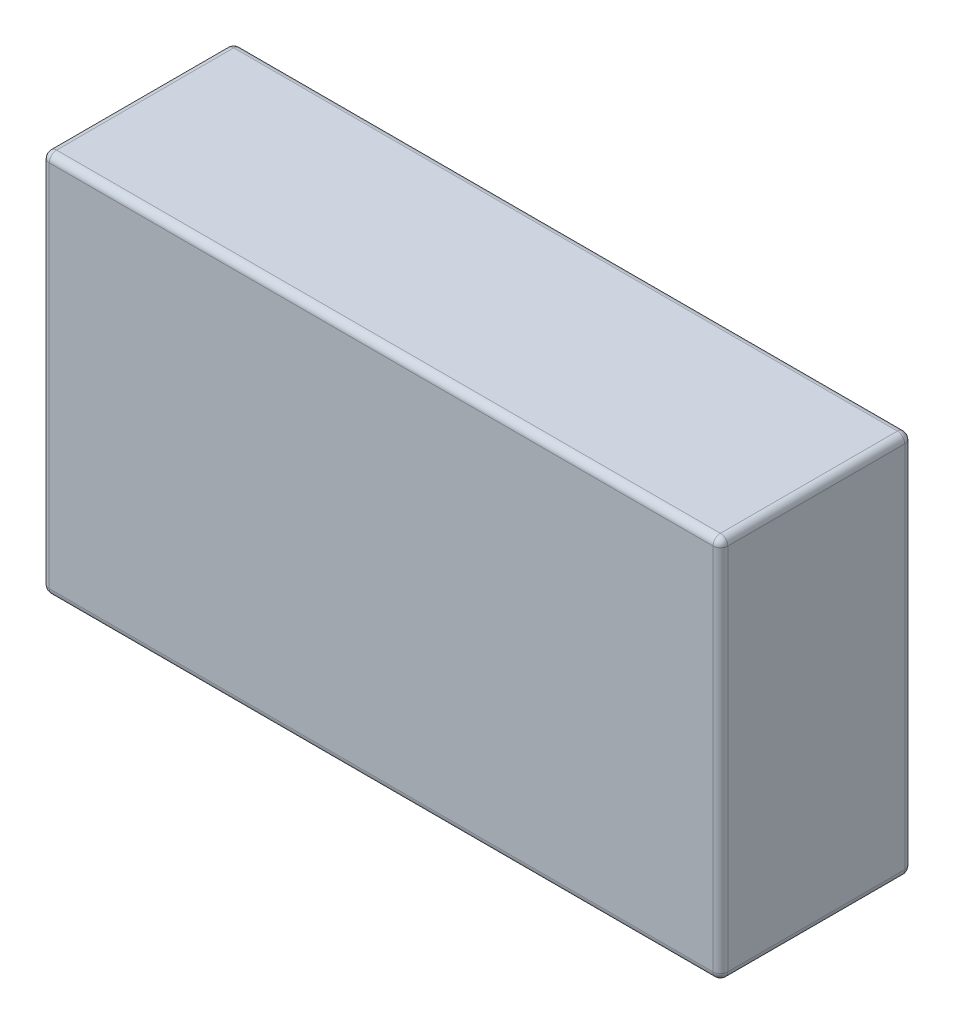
ISO-10303-21;
HEADER;
FILE_DESCRIPTION(('STEP AP214'),'2;1');
FILE_NAME('part.step','',(''),(''),'','','');
FILE_SCHEMA(('AUTOMOTIVE_DESIGN { 1 0 10303 214 1 1 1 1 }'));
ENDSEC;
DATA;
#1=APPLICATION_CONTEXT('core data for automotive mechanical design processes');
#2=APPLICATION_PROTOCOL_DEFINITION('international standard','automotive_design',2000,#1);
#3=PRODUCT_CONTEXT('',#1,'mechanical');
#4=PRODUCT('Part','Part','',(#3));
#5=PRODUCT_RELATED_PRODUCT_CATEGORY('part','',(#4));
#6=PRODUCT_DEFINITION_FORMATION('','',#4);
#7=PRODUCT_DEFINITION_CONTEXT('part definition',#1,'design');
#8=PRODUCT_DEFINITION('design','',#6,#7);
#9=PRODUCT_DEFINITION_SHAPE('','',#8);
#10=(LENGTH_UNIT() NAMED_UNIT(*) SI_UNIT(.MILLI.,.METRE.));
#11=(NAMED_UNIT(*) PLANE_ANGLE_UNIT() SI_UNIT($,.RADIAN.));
#12=(NAMED_UNIT(*) SI_UNIT($,.STERADIAN.) SOLID_ANGLE_UNIT());
#13=UNCERTAINTY_MEASURE_WITH_UNIT(LENGTH_MEASURE(1.E-05),#10,'distance_accuracy_value','');
#14=(GEOMETRIC_REPRESENTATION_CONTEXT(3) GLOBAL_UNCERTAINTY_ASSIGNED_CONTEXT((#13)) GLOBAL_UNIT_ASSIGNED_CONTEXT((#10,
#11,#12)) REPRESENTATION_CONTEXT('',''));
#15=CARTESIAN_POINT('',(0.,0.,0.));
#16=DIRECTION('',(0.,0.,1.));
#17=DIRECTION('',(1.,0.,0.));
#18=AXIS2_PLACEMENT_3D('',#15,#16,#17);
#19=CARTESIAN_POINT('',(0.,0.,13.));
#20=DIRECTION('',(1.,0.,0.));
#21=DIRECTION('',(0.,1.,0.));
#22=AXIS2_PLACEMENT_3D('',#19,#20,#21);
#23=PLANE('',#22);
#24=DIRECTION('',(0.,-1.,0.));
#25=VECTOR('',#24,1.);
#26=CARTESIAN_POINT('',(0.,0.,0.5));
#27=LINE('',#26,#25);
#28=CARTESIAN_POINT('',(0.,25.5,0.5));
#29=VERTEX_POINT('',#28);
#30=CARTESIAN_POINT('',(0.,0.5,0.5));
#31=VERTEX_POINT('',#30);
#32=EDGE_CURVE('E180',#29,#31,#27,.T.);
#33=ORIENTED_EDGE('',*,*,#32,.T.);
#34=DIRECTION('',(0.,0.,-1.));
#35=VECTOR('',#34,1.);
#36=CARTESIAN_POINT('',(0.,0.5,13.));
#37=LINE('',#36,#35);
#38=CARTESIAN_POINT('',(0.,0.5,12.5));
#39=VERTEX_POINT('',#38);
#40=EDGE_CURVE('E182',#31,#39,#37,.F.);
#41=ORIENTED_EDGE('',*,*,#40,.T.);
#42=DIRECTION('',(0.,-1.,0.));
#43=VECTOR('',#42,1.);
#44=CARTESIAN_POINT('',(0.,0.,12.5));
#45=LINE('',#44,#43);
#46=CARTESIAN_POINT('',(0.,25.5,12.5));
#47=VERTEX_POINT('',#46);
#48=EDGE_CURVE('E176',#39,#47,#45,.F.);
#49=ORIENTED_EDGE('',*,*,#48,.T.);
#50=DIRECTION('',(0.,0.,-1.));
#51=VECTOR('',#50,1.);
#52=CARTESIAN_POINT('',(0.,25.5,13.));
#53=LINE('',#52,#51);
#54=EDGE_CURVE('E178',#47,#29,#53,.T.);
#55=ORIENTED_EDGE('',*,*,#54,.T.);
#56=EDGE_LOOP('',(#33,#41,#49,#55));
#57=FACE_BOUND('',#56,.T.);
#58=ADVANCED_FACE('F45',(#57),#23,.F.);
#59=CARTESIAN_POINT('',(0.,0.,13.));
#60=DIRECTION('',(0.,1.,0.));
#61=DIRECTION('',(0.,0.,1.));
#62=AXIS2_PLACEMENT_3D('',#59,#60,#61);
#63=PLANE('',#62);
#64=DIRECTION('',(1.,0.,0.));
#65=VECTOR('',#64,1.);
#66=CARTESIAN_POINT('',(0.,0.,12.5));
#67=LINE('',#66,#65);
#68=CARTESIAN_POINT('',(45.5,0.,12.5));
#69=VERTEX_POINT('',#68);
#70=CARTESIAN_POINT('',(0.5,0.,12.5));
#71=VERTEX_POINT('',#70);
#72=EDGE_CURVE('E137',#69,#71,#67,.F.);
#73=ORIENTED_EDGE('',*,*,#72,.T.);
#74=DIRECTION('',(0.,0.,-1.));
#75=VECTOR('',#74,1.);
#76=CARTESIAN_POINT('',(0.5,0.,13.));
#77=LINE('',#76,#75);
#78=CARTESIAN_POINT('',(0.5,0.,0.5));
#79=VERTEX_POINT('',#78);
#80=EDGE_CURVE('E174',#71,#79,#77,.T.);
#81=ORIENTED_EDGE('',*,*,#80,.T.);
#82=DIRECTION('',(1.,0.,0.));
#83=VECTOR('',#82,1.);
#84=CARTESIAN_POINT('',(46.,0.,0.5));
#85=LINE('',#84,#83);
#86=CARTESIAN_POINT('',(45.5,0.,0.5));
#87=VERTEX_POINT('',#86);
#88=EDGE_CURVE('E140',#79,#87,#85,.T.);
#89=ORIENTED_EDGE('',*,*,#88,.T.);
#90=DIRECTION('',(0.,0.,-1.));
#91=VECTOR('',#90,1.);
#92=CARTESIAN_POINT('',(45.5,0.,13.));
#93=LINE('',#92,#91);
#94=EDGE_CURVE('E132',#87,#69,#93,.F.);
#95=ORIENTED_EDGE('',*,*,#94,.T.);
#96=EDGE_LOOP('',(#73,#81,#89,#95));
#97=FACE_BOUND('',#96,.T.);
#98=ADVANCED_FACE('F134',(#97),#63,.F.);
#99=CARTESIAN_POINT('',(46.,0.,13.));
#100=DIRECTION('',(-1.,0.,0.));
#101=DIRECTION('',(0.,-1.,0.));
#102=AXIS2_PLACEMENT_3D('',#99,#100,#101);
#103=PLANE('',#102);
#104=DIRECTION('',(0.,0.,-1.));
#105=VECTOR('',#104,1.);
#106=CARTESIAN_POINT('',(46.,0.5,13.));
#107=LINE('',#106,#105);
#108=CARTESIAN_POINT('',(46.,0.5,12.5));
#109=VERTEX_POINT('',#108);
#110=CARTESIAN_POINT('',(46.,0.5,0.5));
#111=VERTEX_POINT('',#110);
#112=EDGE_CURVE('E151',#109,#111,#107,.T.);
#113=ORIENTED_EDGE('',*,*,#112,.T.);
#114=DIRECTION('',(0.,1.,0.));
#115=VECTOR('',#114,1.);
#116=CARTESIAN_POINT('',(46.,26.,0.5));
#117=LINE('',#116,#115);
#118=CARTESIAN_POINT('',(46.,25.5,0.5));
#119=VERTEX_POINT('',#118);
#120=EDGE_CURVE('E208',#111,#119,#117,.T.);
#121=ORIENTED_EDGE('',*,*,#120,.T.);
#122=DIRECTION('',(0.,0.,-1.));
#123=VECTOR('',#122,1.);
#124=CARTESIAN_POINT('',(46.,25.5,13.));
#125=LINE('',#124,#123);
#126=CARTESIAN_POINT('',(46.,25.5,12.5));
#127=VERTEX_POINT('',#126);
#128=EDGE_CURVE('E205',#119,#127,#125,.F.);
#129=ORIENTED_EDGE('',*,*,#128,.T.);
#130=DIRECTION('',(0.,1.,0.));
#131=VECTOR('',#130,1.);
#132=CARTESIAN_POINT('',(46.,0.,12.5));
#133=LINE('',#132,#131);
#134=EDGE_CURVE('E203',#127,#109,#133,.F.);
#135=ORIENTED_EDGE('',*,*,#134,.T.);
#136=EDGE_LOOP('',(#113,#121,#129,#135));
#137=FACE_BOUND('',#136,.T.);
#138=ADVANCED_FACE('F308',(#137),#103,.F.);
#139=CARTESIAN_POINT('',(0.,26.,13.));
#140=DIRECTION('',(0.,-1.,0.));
#141=DIRECTION('',(0.,0.,-1.));
#142=AXIS2_PLACEMENT_3D('',#139,#140,#141);
#143=PLANE('',#142);
#144=DIRECTION('',(-1.,0.,0.));
#145=VECTOR('',#144,1.);
#146=CARTESIAN_POINT('',(0.,26.,0.5));
#147=LINE('',#146,#145);
#148=CARTESIAN_POINT('',(45.5,26.,0.5));
#149=VERTEX_POINT('',#148);
#150=CARTESIAN_POINT('',(0.499999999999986,26.,0.5));
#151=VERTEX_POINT('',#150);
#152=EDGE_CURVE('E198',#149,#151,#147,.T.);
#153=ORIENTED_EDGE('',*,*,#152,.T.);
#154=DIRECTION('',(0.,0.,-1.));
#155=VECTOR('',#154,1.);
#156=CARTESIAN_POINT('',(0.499999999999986,26.,13.));
#157=LINE('',#156,#155);
#158=CARTESIAN_POINT('',(0.499999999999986,26.,12.5));
#159=VERTEX_POINT('',#158);
#160=EDGE_CURVE('E200',#151,#159,#157,.F.);
#161=ORIENTED_EDGE('',*,*,#160,.T.);
#162=DIRECTION('',(-1.,0.,0.));
#163=VECTOR('',#162,1.);
#164=CARTESIAN_POINT('',(0.,26.,12.5));
#165=LINE('',#164,#163);
#166=CARTESIAN_POINT('',(45.5,26.,12.5));
#167=VERTEX_POINT('',#166);
#168=EDGE_CURVE('E194',#159,#167,#165,.F.);
#169=ORIENTED_EDGE('',*,*,#168,.T.);
#170=DIRECTION('',(0.,0.,-1.));
#171=VECTOR('',#170,1.);
#172=CARTESIAN_POINT('',(45.5,26.,13.));
#173=LINE('',#172,#171);
#174=EDGE_CURVE('E196',#167,#149,#173,.T.);
#175=ORIENTED_EDGE('',*,*,#174,.T.);
#176=EDGE_LOOP('',(#153,#161,#169,#175));
#177=FACE_BOUND('',#176,.T.);
#178=ADVANCED_FACE('F285',(#177),#143,.F.);
#179=CARTESIAN_POINT('',(0.,0.,13.));
#180=DIRECTION('',(0.,0.,-1.));
#181=DIRECTION('',(-1.,0.,0.));
#182=AXIS2_PLACEMENT_3D('',#179,#180,#181);
#183=PLANE('',#182);
#184=DIRECTION('',(0.,1.,0.));
#185=VECTOR('',#184,1.);
#186=CARTESIAN_POINT('',(45.5,0.,13.));
#187=LINE('',#186,#185);
#188=CARTESIAN_POINT('',(45.5,0.5,13.));
#189=VERTEX_POINT('',#188);
#190=CARTESIAN_POINT('',(45.5,25.5,13.));
#191=VERTEX_POINT('',#190);
#192=EDGE_CURVE('E54',#189,#191,#187,.T.);
#193=ORIENTED_EDGE('',*,*,#192,.T.);
#194=DIRECTION('',(-1.,0.,0.));
#195=VECTOR('',#194,1.);
#196=CARTESIAN_POINT('',(0.,25.5,13.));
#197=LINE('',#196,#195);
#198=CARTESIAN_POINT('',(0.499999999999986,25.5,13.));
#199=VERTEX_POINT('',#198);
#200=EDGE_CURVE('E11',#191,#199,#197,.T.);
#201=ORIENTED_EDGE('',*,*,#200,.T.);
#202=DIRECTION('',(0.,-1.,0.));
#203=VECTOR('',#202,1.);
#204=CARTESIAN_POINT('',(0.5,0.,13.));
#205=LINE('',#204,#203);
#206=CARTESIAN_POINT('',(0.5,0.5,13.));
#207=VERTEX_POINT('',#206);
#208=EDGE_CURVE('E210',#199,#207,#205,.T.);
#209=ORIENTED_EDGE('',*,*,#208,.T.);
#210=DIRECTION('',(1.,0.,0.));
#211=VECTOR('',#210,1.);
#212=CARTESIAN_POINT('',(0.,0.5,13.));
#213=LINE('',#212,#211);
#214=EDGE_CURVE('E65',#207,#189,#213,.T.);
#215=ORIENTED_EDGE('',*,*,#214,.T.);
#216=EDGE_LOOP('',(#193,#201,#209,#215));
#217=FACE_BOUND('',#216,.T.);
#218=ADVANCED_FACE('F315',(#217),#183,.F.);
#219=CARTESIAN_POINT('',(0.,0.,0.));
#220=DIRECTION('',(0.,0.,-1.));
#221=DIRECTION('',(-1.,0.,0.));
#222=AXIS2_PLACEMENT_3D('',#219,#220,#221);
#223=PLANE('',#222);
#224=DIRECTION('',(0.,1.,0.));
#225=VECTOR('',#224,1.);
#226=CARTESIAN_POINT('',(45.5,0.,0.));
#227=LINE('',#226,#225);
#228=CARTESIAN_POINT('',(45.5,25.5,0.));
#229=VERTEX_POINT('',#228);
#230=CARTESIAN_POINT('',(45.5,0.5,0.));
#231=VERTEX_POINT('',#230);
#232=EDGE_CURVE('E185',#229,#231,#227,.F.);
#233=ORIENTED_EDGE('',*,*,#232,.T.);
#234=DIRECTION('',(1.,0.,0.));
#235=VECTOR('',#234,1.);
#236=CARTESIAN_POINT('',(0.,0.5,0.));
#237=LINE('',#236,#235);
#238=CARTESIAN_POINT('',(0.5,0.5,0.));
#239=VERTEX_POINT('',#238);
#240=EDGE_CURVE('E191',#231,#239,#237,.F.);
#241=ORIENTED_EDGE('',*,*,#240,.T.);
#242=DIRECTION('',(0.,-1.,0.));
#243=VECTOR('',#242,1.);
#244=CARTESIAN_POINT('',(0.499999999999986,26.,0.));
#245=LINE('',#244,#243);
#246=CARTESIAN_POINT('',(0.499999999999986,25.5,0.));
#247=VERTEX_POINT('',#246);
#248=EDGE_CURVE('E189',#239,#247,#245,.F.);
#249=ORIENTED_EDGE('',*,*,#248,.T.);
#250=DIRECTION('',(-1.,0.,0.));
#251=VECTOR('',#250,1.);
#252=CARTESIAN_POINT('',(46.,25.5,0.));
#253=LINE('',#252,#251);
#254=EDGE_CURVE('E187',#247,#229,#253,.F.);
#255=ORIENTED_EDGE('',*,*,#254,.T.);
#256=EDGE_LOOP('',(#233,#241,#249,#255));
#257=FACE_BOUND('',#256,.T.);
#258=ADVANCED_FACE('F276',(#257),#223,.T.);
#259=CARTESIAN_POINT('',(45.5,25.5,13.));
#260=DIRECTION('',(0.,0.,-1.));
#261=DIRECTION('',(-1.,0.,0.));
#262=AXIS2_PLACEMENT_3D('',#259,#260,#261);
#263=CYLINDRICAL_SURFACE('',#262,0.5);
#264=CARTESIAN_POINT('',(45.5,25.5,12.5));
#265=DIRECTION('',(0.,0.,1.));
#266=DIRECTION('',(1.,0.,0.));
#267=AXIS2_PLACEMENT_3D('',#264,#265,#266);
#268=CIRCLE('',#267,0.5);
#269=EDGE_CURVE('E49',#127,#167,#268,.T.);
#270=ORIENTED_EDGE('',*,*,#269,.F.);
#271=ORIENTED_EDGE('',*,*,#128,.F.);
#272=CARTESIAN_POINT('',(45.5,25.5,0.5));
#273=DIRECTION('',(0.,0.,-1.));
#274=DIRECTION('',(-1.,0.,0.));
#275=AXIS2_PLACEMENT_3D('',#272,#273,#274);
#276=CIRCLE('',#275,0.5);
#277=EDGE_CURVE('E171',#149,#119,#276,.T.);
#278=ORIENTED_EDGE('',*,*,#277,.F.);
#279=ORIENTED_EDGE('',*,*,#174,.F.);
#280=EDGE_LOOP('',(#270,#271,#278,#279));
#281=FACE_BOUND('',#280,.T.);
#282=ADVANCED_FACE('F47',(#281),#263,.T.);
#283=CARTESIAN_POINT('',(45.5,25.5,12.5));
#284=DIRECTION('',(0.,1.,0.));
#285=DIRECTION('',(0.,0.,1.));
#286=AXIS2_PLACEMENT_3D('',#283,#284,#285);
#287=SPHERICAL_SURFACE('',#286,0.5);
#288=CARTESIAN_POINT('',(45.5,25.5,12.5));
#289=DIRECTION('',(0.,1.,0.));
#290=DIRECTION('',(0.,0.,1.));
#291=AXIS2_PLACEMENT_3D('',#288,#289,#290);
#292=CIRCLE('',#291,0.5);
#293=EDGE_CURVE('E255',#127,#191,#292,.F.);
#294=ORIENTED_EDGE('',*,*,#293,.F.);
#295=ORIENTED_EDGE('',*,*,#269,.T.);
#296=CARTESIAN_POINT('',(45.5,25.5,12.5));
#297=DIRECTION('',(1.,0.,0.));
#298=DIRECTION('',(0.,0.,-1.));
#299=AXIS2_PLACEMENT_3D('',#296,#297,#298);
#300=CIRCLE('',#299,0.5);
#301=EDGE_CURVE('E257',#191,#167,#300,.F.);
#302=ORIENTED_EDGE('',*,*,#301,.F.);
#303=EDGE_LOOP('',(#294,#295,#302));
#304=FACE_BOUND('',#303,.T.);
#305=ADVANCED_FACE('F303',(#304),#287,.T.);
#306=CARTESIAN_POINT('',(45.5,25.5,0.5));
#307=DIRECTION('',(1.,0.,0.));
#308=DIRECTION('',(0.,0.,-1.));
#309=AXIS2_PLACEMENT_3D('',#306,#307,#308);
#310=SPHERICAL_SURFACE('',#309,0.5);
#311=CARTESIAN_POINT('',(45.5,25.5,0.5));
#312=DIRECTION('',(1.,0.,0.));
#313=DIRECTION('',(0.,0.,-1.));
#314=AXIS2_PLACEMENT_3D('',#311,#312,#313);
#315=CIRCLE('',#314,0.5);
#316=EDGE_CURVE('E249',#149,#229,#315,.F.);
#317=ORIENTED_EDGE('',*,*,#316,.F.);
#318=ORIENTED_EDGE('',*,*,#277,.T.);
#319=CARTESIAN_POINT('',(45.5,25.5,0.5));
#320=DIRECTION('',(0.,1.,0.));
#321=DIRECTION('',(0.,0.,1.));
#322=AXIS2_PLACEMENT_3D('',#319,#320,#321);
#323=CIRCLE('',#322,0.5);
#324=EDGE_CURVE('E252',#229,#119,#323,.F.);
#325=ORIENTED_EDGE('',*,*,#324,.F.);
#326=EDGE_LOOP('',(#317,#318,#325));
#327=FACE_BOUND('',#326,.T.);
#328=ADVANCED_FACE('F264',(#327),#310,.T.);
#329=CARTESIAN_POINT('',(0.,25.5,12.5));
#330=DIRECTION('',(-1.,0.,0.));
#331=DIRECTION('',(0.,0.,1.));
#332=AXIS2_PLACEMENT_3D('',#329,#330,#331);
#333=CYLINDRICAL_SURFACE('',#332,0.5);
#334=ORIENTED_EDGE('',*,*,#301,.T.);
#335=ORIENTED_EDGE('',*,*,#168,.F.);
#336=CARTESIAN_POINT('',(0.499999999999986,25.5,12.5));
#337=DIRECTION('',(-1.,0.,0.));
#338=DIRECTION('',(0.,0.,1.));
#339=AXIS2_PLACEMENT_3D('',#336,#337,#338);
#340=CIRCLE('',#339,0.5);
#341=EDGE_CURVE('E244',#199,#159,#340,.T.);
#342=ORIENTED_EDGE('',*,*,#341,.F.);
#343=ORIENTED_EDGE('',*,*,#200,.F.);
#344=EDGE_LOOP('',(#334,#335,#342,#343));
#345=FACE_BOUND('',#344,.T.);
#346=ADVANCED_FACE('F297',(#345),#333,.T.);
#347=CARTESIAN_POINT('',(45.5,0.,12.5));
#348=DIRECTION('',(0.,1.,0.));
#349=DIRECTION('',(-1.,0.,0.));
#350=AXIS2_PLACEMENT_3D('',#347,#348,#349);
#351=CYLINDRICAL_SURFACE('',#350,0.5);
#352=ORIENTED_EDGE('',*,*,#293,.T.);
#353=ORIENTED_EDGE('',*,*,#192,.F.);
#354=CARTESIAN_POINT('',(45.5,0.5,12.5));
#355=DIRECTION('',(0.,-1.,0.));
#356=DIRECTION('',(1.,0.,0.));
#357=AXIS2_PLACEMENT_3D('',#354,#355,#356);
#358=CIRCLE('',#357,0.5);
#359=EDGE_CURVE('E155',#109,#189,#358,.T.);
#360=ORIENTED_EDGE('',*,*,#359,.F.);
#361=ORIENTED_EDGE('',*,*,#134,.F.);
#362=EDGE_LOOP('',(#352,#353,#360,#361));
#363=FACE_BOUND('',#362,.T.);
#364=ADVANCED_FACE('F306',(#363),#351,.T.);
#365=CARTESIAN_POINT('',(45.5,0.5,13.));
#366=DIRECTION('',(0.,0.,-1.));
#367=DIRECTION('',(-1.,0.,0.));
#368=AXIS2_PLACEMENT_3D('',#365,#366,#367);
#369=CYLINDRICAL_SURFACE('',#368,0.5);
#370=CARTESIAN_POINT('',(45.5,0.5,0.5));
#371=DIRECTION('',(0.,0.,-1.));
#372=DIRECTION('',(-1.,0.,0.));
#373=AXIS2_PLACEMENT_3D('',#370,#371,#372);
#374=CIRCLE('',#373,0.5);
#375=EDGE_CURVE('E156',#111,#87,#374,.T.);
#376=ORIENTED_EDGE('',*,*,#375,.F.);
#377=ORIENTED_EDGE('',*,*,#112,.F.);
#378=CARTESIAN_POINT('',(45.5,0.5,12.5));
#379=DIRECTION('',(0.,0.,1.));
#380=DIRECTION('',(1.,0.,0.));
#381=AXIS2_PLACEMENT_3D('',#378,#379,#380);
#382=CIRCLE('',#381,0.5);
#383=EDGE_CURVE('E147',#69,#109,#382,.T.);
#384=ORIENTED_EDGE('',*,*,#383,.F.);
#385=ORIENTED_EDGE('',*,*,#94,.F.);
#386=EDGE_LOOP('',(#376,#377,#384,#385));
#387=FACE_BOUND('',#386,.T.);
#388=ADVANCED_FACE('F149',(#387),#369,.T.);
#389=CARTESIAN_POINT('',(45.5,0.,0.5));
#390=DIRECTION('',(0.,-1.,0.));
#391=DIRECTION('',(1.,0.,0.));
#392=AXIS2_PLACEMENT_3D('',#389,#390,#391);
#393=CYLINDRICAL_SURFACE('',#392,0.5);
#394=ORIENTED_EDGE('',*,*,#324,.T.);
#395=ORIENTED_EDGE('',*,*,#120,.F.);
#396=CARTESIAN_POINT('',(45.5,0.5,0.5));
#397=DIRECTION('',(0.,-1.,0.));
#398=DIRECTION('',(1.,0.,0.));
#399=AXIS2_PLACEMENT_3D('',#396,#397,#398);
#400=CIRCLE('',#399,0.5);
#401=EDGE_CURVE('E240',#231,#111,#400,.T.);
#402=ORIENTED_EDGE('',*,*,#401,.F.);
#403=ORIENTED_EDGE('',*,*,#232,.F.);
#404=EDGE_LOOP('',(#394,#395,#402,#403));
#405=FACE_BOUND('',#404,.T.);
#406=ADVANCED_FACE('F272',(#405),#393,.T.);
#407=CARTESIAN_POINT('',(0.,25.5,0.5));
#408=DIRECTION('',(1.,0.,0.));
#409=DIRECTION('',(0.,0.,-1.));
#410=AXIS2_PLACEMENT_3D('',#407,#408,#409);
#411=CYLINDRICAL_SURFACE('',#410,0.5);
#412=ORIENTED_EDGE('',*,*,#316,.T.);
#413=ORIENTED_EDGE('',*,*,#254,.F.);
#414=CARTESIAN_POINT('',(0.499999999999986,25.5,0.5));
#415=DIRECTION('',(-1.,0.,0.));
#416=DIRECTION('',(0.,0.,1.));
#417=AXIS2_PLACEMENT_3D('',#414,#415,#416);
#418=CIRCLE('',#417,0.5);
#419=EDGE_CURVE('E237',#151,#247,#418,.T.);
#420=ORIENTED_EDGE('',*,*,#419,.F.);
#421=ORIENTED_EDGE('',*,*,#152,.F.);
#422=EDGE_LOOP('',(#412,#413,#420,#421));
#423=FACE_BOUND('',#422,.T.);
#424=ADVANCED_FACE('F282',(#423),#411,.T.);
#425=CARTESIAN_POINT('',(0.499999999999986,25.5,13.));
#426=DIRECTION('',(0.,0.,-1.));
#427=DIRECTION('',(-1.,0.,0.));
#428=AXIS2_PLACEMENT_3D('',#425,#426,#427);
#429=CYLINDRICAL_SURFACE('',#428,0.5);
#430=CARTESIAN_POINT('',(0.499999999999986,25.5,12.5));
#431=DIRECTION('',(0.,0.,1.));
#432=DIRECTION('',(1.,0.,0.));
#433=AXIS2_PLACEMENT_3D('',#430,#431,#432);
#434=CIRCLE('',#433,0.5);
#435=EDGE_CURVE('E246',#159,#47,#434,.T.);
#436=ORIENTED_EDGE('',*,*,#435,.F.);
#437=ORIENTED_EDGE('',*,*,#160,.F.);
#438=CARTESIAN_POINT('',(0.499999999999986,25.5,0.5));
#439=DIRECTION('',(0.,0.,-1.));
#440=DIRECTION('',(-1.,0.,0.));
#441=AXIS2_PLACEMENT_3D('',#438,#439,#440);
#442=CIRCLE('',#441,0.5);
#443=EDGE_CURVE('E234',#29,#151,#442,.T.);
#444=ORIENTED_EDGE('',*,*,#443,.F.);
#445=ORIENTED_EDGE('',*,*,#54,.F.);
#446=EDGE_LOOP('',(#436,#437,#444,#445));
#447=FACE_BOUND('',#446,.T.);
#448=ADVANCED_FACE('F289',(#447),#429,.T.);
#449=CARTESIAN_POINT('',(0.499999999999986,25.5,12.5));
#450=DIRECTION('',(0.,1.,0.));
#451=DIRECTION('',(0.,0.,1.));
#452=AXIS2_PLACEMENT_3D('',#449,#450,#451);
#453=SPHERICAL_SURFACE('',#452,0.5);
#454=ORIENTED_EDGE('',*,*,#341,.T.);
#455=ORIENTED_EDGE('',*,*,#435,.T.);
#456=CARTESIAN_POINT('',(0.499999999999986,25.5,12.5));
#457=DIRECTION('',(0.,1.,0.));
#458=DIRECTION('',(0.,0.,1.));
#459=AXIS2_PLACEMENT_3D('',#456,#457,#458);
#460=CIRCLE('',#459,0.5);
#461=EDGE_CURVE('E162',#199,#47,#460,.F.);
#462=ORIENTED_EDGE('',*,*,#461,.F.);
#463=EDGE_LOOP('',(#454,#455,#462));
#464=FACE_BOUND('',#463,.T.);
#465=ADVANCED_FACE('F360',(#464),#453,.T.);
#466=CARTESIAN_POINT('',(45.5,0.5,12.5));
#467=DIRECTION('',(1.,0.,0.));
#468=DIRECTION('',(0.,1.,0.));
#469=AXIS2_PLACEMENT_3D('',#466,#467,#468);
#470=SPHERICAL_SURFACE('',#469,0.5);
#471=ORIENTED_EDGE('',*,*,#383,.T.);
#472=ORIENTED_EDGE('',*,*,#359,.T.);
#473=CARTESIAN_POINT('',(45.5,0.5,12.5));
#474=DIRECTION('',(1.,0.,0.));
#475=DIRECTION('',(0.,0.,-1.));
#476=AXIS2_PLACEMENT_3D('',#473,#474,#475);
#477=CIRCLE('',#476,0.5);
#478=EDGE_CURVE('E159',#69,#189,#477,.F.);
#479=ORIENTED_EDGE('',*,*,#478,.F.);
#480=EDGE_LOOP('',(#471,#472,#479));
#481=FACE_BOUND('',#480,.T.);
#482=ADVANCED_FACE('F160',(#481),#470,.T.);
#483=CARTESIAN_POINT('',(45.5,0.5,0.5));
#484=DIRECTION('',(1.,0.,0.));
#485=DIRECTION('',(0.,0.,-1.));
#486=AXIS2_PLACEMENT_3D('',#483,#484,#485);
#487=SPHERICAL_SURFACE('',#486,0.5);
#488=ORIENTED_EDGE('',*,*,#401,.T.);
#489=ORIENTED_EDGE('',*,*,#375,.T.);
#490=CARTESIAN_POINT('',(45.5,0.5,0.5));
#491=DIRECTION('',(1.,0.,0.));
#492=DIRECTION('',(0.,0.,-1.));
#493=AXIS2_PLACEMENT_3D('',#490,#491,#492);
#494=CIRCLE('',#493,0.5);
#495=EDGE_CURVE('E163',#231,#87,#494,.F.);
#496=ORIENTED_EDGE('',*,*,#495,.F.);
#497=EDGE_LOOP('',(#488,#489,#496));
#498=FACE_BOUND('',#497,.T.);
#499=ADVANCED_FACE('F353',(#498),#487,.T.);
#500=CARTESIAN_POINT('',(0.499999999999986,25.5,0.5));
#501=DIRECTION('',(0.,1.,0.));
#502=DIRECTION('',(0.,0.,1.));
#503=AXIS2_PLACEMENT_3D('',#500,#501,#502);
#504=SPHERICAL_SURFACE('',#503,0.5);
#505=ORIENTED_EDGE('',*,*,#443,.T.);
#506=ORIENTED_EDGE('',*,*,#419,.T.);
#507=CARTESIAN_POINT('',(0.499999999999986,25.5,0.5));
#508=DIRECTION('',(0.,1.,0.));
#509=DIRECTION('',(0.,0.,1.));
#510=AXIS2_PLACEMENT_3D('',#507,#508,#509);
#511=CIRCLE('',#510,0.5);
#512=EDGE_CURVE('E227',#29,#247,#511,.F.);
#513=ORIENTED_EDGE('',*,*,#512,.F.);
#514=EDGE_LOOP('',(#505,#506,#513));
#515=FACE_BOUND('',#514,.T.);
#516=ADVANCED_FACE('F349',(#515),#504,.T.);
#517=CARTESIAN_POINT('',(0.5,0.,12.5));
#518=DIRECTION('',(0.,-1.,0.));
#519=DIRECTION('',(1.,0.,0.));
#520=AXIS2_PLACEMENT_3D('',#517,#518,#519);
#521=CYLINDRICAL_SURFACE('',#520,0.5);
#522=ORIENTED_EDGE('',*,*,#461,.T.);
#523=ORIENTED_EDGE('',*,*,#48,.F.);
#524=CARTESIAN_POINT('',(0.5,0.5,12.5));
#525=DIRECTION('',(0.,-1.,0.));
#526=DIRECTION('',(1.,0.,0.));
#527=AXIS2_PLACEMENT_3D('',#524,#525,#526);
#528=CIRCLE('',#527,0.5);
#529=EDGE_CURVE('E224',#207,#39,#528,.T.);
#530=ORIENTED_EDGE('',*,*,#529,.F.);
#531=ORIENTED_EDGE('',*,*,#208,.F.);
#532=EDGE_LOOP('',(#522,#523,#530,#531));
#533=FACE_BOUND('',#532,.T.);
#534=ADVANCED_FACE('F346',(#533),#521,.T.);
#535=CARTESIAN_POINT('',(0.,0.5,12.5));
#536=DIRECTION('',(1.,0.,0.));
#537=DIRECTION('',(0.,0.,-1.));
#538=AXIS2_PLACEMENT_3D('',#535,#536,#537);
#539=CYLINDRICAL_SURFACE('',#538,0.5);
#540=ORIENTED_EDGE('',*,*,#478,.T.);
#541=ORIENTED_EDGE('',*,*,#214,.F.);
#542=CARTESIAN_POINT('',(0.5,0.5,12.5));
#543=DIRECTION('',(-1.,0.,0.));
#544=DIRECTION('',(0.,0.,1.));
#545=AXIS2_PLACEMENT_3D('',#542,#543,#544);
#546=CIRCLE('',#545,0.5);
#547=EDGE_CURVE('E167',#71,#207,#546,.T.);
#548=ORIENTED_EDGE('',*,*,#547,.F.);
#549=ORIENTED_EDGE('',*,*,#72,.F.);
#550=EDGE_LOOP('',(#540,#541,#548,#549));
#551=FACE_BOUND('',#550,.T.);
#552=ADVANCED_FACE('F165',(#551),#539,.T.);
#553=CARTESIAN_POINT('',(0.,0.5,0.5));
#554=DIRECTION('',(-1.,0.,0.));
#555=DIRECTION('',(0.,0.,1.));
#556=AXIS2_PLACEMENT_3D('',#553,#554,#555);
#557=CYLINDRICAL_SURFACE('',#556,0.5);
#558=ORIENTED_EDGE('',*,*,#495,.T.);
#559=ORIENTED_EDGE('',*,*,#88,.F.);
#560=CARTESIAN_POINT('',(0.5,0.5,0.5));
#561=DIRECTION('',(-1.,0.,0.));
#562=DIRECTION('',(0.,0.,1.));
#563=AXIS2_PLACEMENT_3D('',#560,#561,#562);
#564=CIRCLE('',#563,0.5);
#565=EDGE_CURVE('E220',#239,#79,#564,.T.);
#566=ORIENTED_EDGE('',*,*,#565,.F.);
#567=ORIENTED_EDGE('',*,*,#240,.F.);
#568=EDGE_LOOP('',(#558,#559,#566,#567));
#569=FACE_BOUND('',#568,.T.);
#570=ADVANCED_FACE('F339',(#569),#557,.T.);
#571=CARTESIAN_POINT('',(0.5,0.,0.5));
#572=DIRECTION('',(0.,1.,0.));
#573=DIRECTION('',(-1.,0.,0.));
#574=AXIS2_PLACEMENT_3D('',#571,#572,#573);
#575=CYLINDRICAL_SURFACE('',#574,0.5);
#576=ORIENTED_EDGE('',*,*,#512,.T.);
#577=ORIENTED_EDGE('',*,*,#248,.F.);
#578=CARTESIAN_POINT('',(0.5,0.5,0.5));
#579=DIRECTION('',(0.,-1.,0.));
#580=DIRECTION('',(1.,0.,0.));
#581=AXIS2_PLACEMENT_3D('',#578,#579,#580);
#582=CIRCLE('',#581,0.5);
#583=EDGE_CURVE('E218',#31,#239,#582,.T.);
#584=ORIENTED_EDGE('',*,*,#583,.F.);
#585=ORIENTED_EDGE('',*,*,#32,.F.);
#586=EDGE_LOOP('',(#576,#577,#584,#585));
#587=FACE_BOUND('',#586,.T.);
#588=ADVANCED_FACE('F335',(#587),#575,.T.);
#589=CARTESIAN_POINT('',(0.5,0.5,12.5));
#590=DIRECTION('',(0.,0.,1.));
#591=DIRECTION('',(1.,0.,0.));
#592=AXIS2_PLACEMENT_3D('',#589,#590,#591);
#593=SPHERICAL_SURFACE('',#592,0.5);
#594=ORIENTED_EDGE('',*,*,#547,.T.);
#595=ORIENTED_EDGE('',*,*,#529,.T.);
#596=CARTESIAN_POINT('',(0.5,0.5,12.5));
#597=DIRECTION('',(0.,0.,1.));
#598=DIRECTION('',(1.,0.,0.));
#599=AXIS2_PLACEMENT_3D('',#596,#597,#598);
#600=CIRCLE('',#599,0.5);
#601=EDGE_CURVE('E216',#71,#39,#600,.F.);
#602=ORIENTED_EDGE('',*,*,#601,.F.);
#603=EDGE_LOOP('',(#594,#595,#602));
#604=FACE_BOUND('',#603,.T.);
#605=ADVANCED_FACE('F331',(#604),#593,.T.);
#606=CARTESIAN_POINT('',(0.5,0.5,0.5));
#607=DIRECTION('',(0.,0.,-1.));
#608=DIRECTION('',(-1.,0.,0.));
#609=AXIS2_PLACEMENT_3D('',#606,#607,#608);
#610=SPHERICAL_SURFACE('',#609,0.5);
#611=ORIENTED_EDGE('',*,*,#583,.T.);
#612=ORIENTED_EDGE('',*,*,#565,.T.);
#613=CARTESIAN_POINT('',(0.5,0.5,0.5));
#614=DIRECTION('',(0.,0.,-1.));
#615=DIRECTION('',(-1.,0.,0.));
#616=AXIS2_PLACEMENT_3D('',#613,#614,#615);
#617=CIRCLE('',#616,0.5);
#618=EDGE_CURVE('E214',#31,#79,#617,.F.);
#619=ORIENTED_EDGE('',*,*,#618,.F.);
#620=EDGE_LOOP('',(#611,#612,#619));
#621=FACE_BOUND('',#620,.T.);
#622=ADVANCED_FACE('F327',(#621),#610,.T.);
#623=CARTESIAN_POINT('',(0.5,0.5,13.));
#624=DIRECTION('',(0.,0.,-1.));
#625=DIRECTION('',(-1.,0.,0.));
#626=AXIS2_PLACEMENT_3D('',#623,#624,#625);
#627=CYLINDRICAL_SURFACE('',#626,0.5);
#628=ORIENTED_EDGE('',*,*,#601,.T.);
#629=ORIENTED_EDGE('',*,*,#40,.F.);
#630=ORIENTED_EDGE('',*,*,#618,.T.);
#631=ORIENTED_EDGE('',*,*,#80,.F.);
#632=EDGE_LOOP('',(#628,#629,#630,#631));
#633=FACE_BOUND('',#632,.T.);
#634=ADVANCED_FACE('F324',(#633),#627,.T.);
#635=CLOSED_SHELL('',(#58,#98,#138,#178,#218,#258,#282,#305,#328,#346,#364,#388,#406,#424,#448,
#465,#482,#499,#516,#534,#552,#570,#588,#605,#622,#634));
#636=MANIFOLD_SOLID_BREP('B2',#635);
#637=ADVANCED_BREP_SHAPE_REPRESENTATION('',(#18,#636),#14);
#638=SHAPE_DEFINITION_REPRESENTATION(#9,#637);
ENDSEC;
END-ISO-10303-21;
